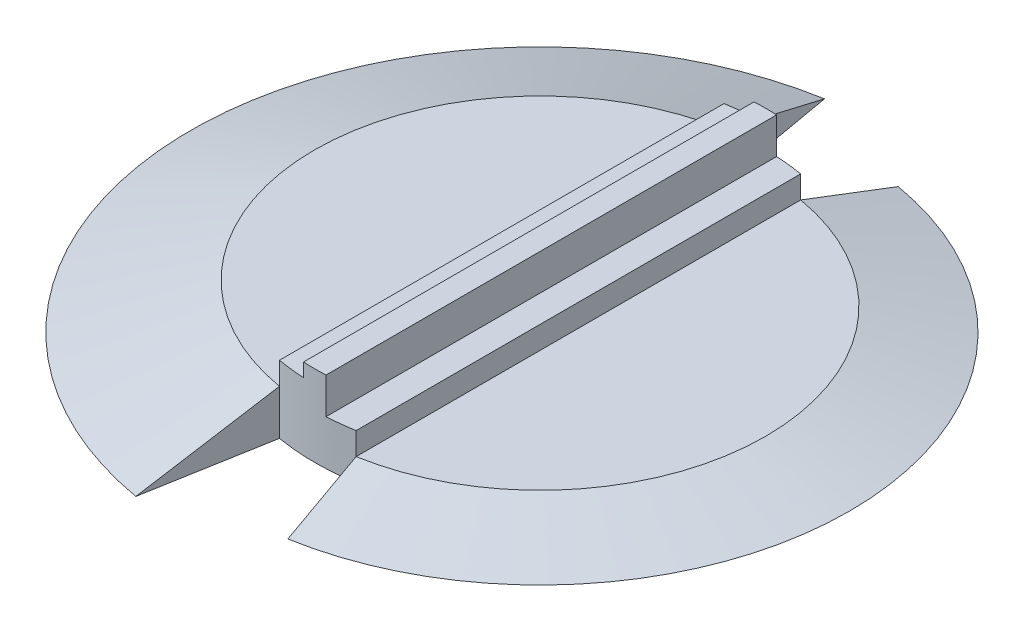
ISO-10303-21;
HEADER;
FILE_DESCRIPTION(('STEP AP214'),'2;1');
FILE_NAME('part.step','',(''),(''),'','','');
FILE_SCHEMA(('AUTOMOTIVE_DESIGN { 1 0 10303 214 1 1 1 1 }'));
ENDSEC;
DATA;
#1=APPLICATION_CONTEXT('core data for automotive mechanical design processes');
#2=APPLICATION_PROTOCOL_DEFINITION('international standard','automotive_design',2000,#1);
#3=PRODUCT_CONTEXT('',#1,'mechanical');
#4=PRODUCT('Part','Part','',(#3));
#5=PRODUCT_RELATED_PRODUCT_CATEGORY('part','',(#4));
#6=PRODUCT_DEFINITION_FORMATION('','',#4);
#7=PRODUCT_DEFINITION_CONTEXT('part definition',#1,'design');
#8=PRODUCT_DEFINITION('design','',#6,#7);
#9=PRODUCT_DEFINITION_SHAPE('','',#8);
#10=(LENGTH_UNIT() NAMED_UNIT(*) SI_UNIT(.MILLI.,.METRE.));
#11=(NAMED_UNIT(*) PLANE_ANGLE_UNIT() SI_UNIT($,.RADIAN.));
#12=(NAMED_UNIT(*) SI_UNIT($,.STERADIAN.) SOLID_ANGLE_UNIT());
#13=UNCERTAINTY_MEASURE_WITH_UNIT(LENGTH_MEASURE(1.E-05),#10,'distance_accuracy_value','');
#14=(GEOMETRIC_REPRESENTATION_CONTEXT(3) GLOBAL_UNCERTAINTY_ASSIGNED_CONTEXT((#13)) GLOBAL_UNIT_ASSIGNED_CONTEXT((#10,
#11,#12)) REPRESENTATION_CONTEXT('',''));
#15=CARTESIAN_POINT('',(0.,0.,0.));
#16=DIRECTION('',(0.,0.,1.));
#17=DIRECTION('',(1.,0.,0.));
#18=AXIS2_PLACEMENT_3D('',#15,#16,#17);
#19=CARTESIAN_POINT('',(-1000.,200.,0.));
#20=DIRECTION('',(0.,1.,0.));
#21=DIRECTION('',(0.,0.,1.));
#22=AXIS2_PLACEMENT_3D('',#19,#20,#21);
#23=PLANE('',#22);
#24=CARTESIAN_POINT('',(0.,200.,0.));
#25=DIRECTION('',(0.,1.,0.));
#26=DIRECTION('',(0.,0.,1.));
#27=AXIS2_PLACEMENT_3D('',#24,#25,#26);
#28=CIRCLE('',#27,1000.);
#29=CARTESIAN_POINT('',(-170.,200.,-985.444062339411));
#30=VERTEX_POINT('',#29);
#31=CARTESIAN_POINT('',(-170.,200.,985.44406233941));
#32=VERTEX_POINT('',#31);
#33=EDGE_CURVE('E249',#30,#32,#28,.T.);
#34=ORIENTED_EDGE('',*,*,#33,.T.);
#35=DIRECTION('',(0.,0.,1.));
#36=VECTOR('',#35,1.);
#37=CARTESIAN_POINT('',(-170.,200.,0.));
#38=LINE('',#37,#36);
#39=EDGE_CURVE('E155',#30,#32,#38,.T.);
#40=ORIENTED_EDGE('',*,*,#39,.F.);
#41=EDGE_LOOP('',(#34,#40));
#42=FACE_BOUND('',#41,.T.);
#43=ADVANCED_FACE('F37',(#42),#23,.T.);
#44=CARTESIAN_POINT('',(0.,0.,0.));
#45=DIRECTION('',(0.,-1.,0.));
#46=DIRECTION('',(0.,0.,-1.));
#47=AXIS2_PLACEMENT_3D('',#44,#45,#46);
#48=PLANE('',#47);
#49=CARTESIAN_POINT('',(0.,0.,0.));
#50=DIRECTION('',(0.,1.,0.));
#51=DIRECTION('',(0.,0.,1.));
#52=AXIS2_PLACEMENT_3D('',#49,#50,#51);
#53=CIRCLE('',#52,1000.);
#54=CARTESIAN_POINT('',(-170.,0.,985.44406233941));
#55=VERTEX_POINT('',#54);
#56=CARTESIAN_POINT('',(170.,0.,985.44406233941));
#57=VERTEX_POINT('',#56);
#58=EDGE_CURVE('E174',#55,#57,#53,.T.);
#59=ORIENTED_EDGE('',*,*,#58,.F.);
#60=DIRECTION('',(-0.173648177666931,0.,0.984807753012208));
#61=VECTOR('',#60,1.);
#62=CARTESIAN_POINT('',(-170.,0.,985.44406233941));
#63=LINE('',#62,#61);
#64=CARTESIAN_POINT('',(-265.41931167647,0.,1526.59386989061));
#65=VERTEX_POINT('',#64);
#66=EDGE_CURVE('E272',#55,#65,#63,.T.);
#67=ORIENTED_EDGE('',*,*,#66,.T.);
#68=CARTESIAN_POINT('',(0.,-2.22044604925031E-13,0.));
#69=DIRECTION('',(0.,1.,0.));
#70=DIRECTION('',(0.,0.,1.));
#71=AXIS2_PLACEMENT_3D('',#68,#69,#70);
#72=CIRCLE('',#71,1549.49548389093);
#73=CARTESIAN_POINT('',(-265.41931167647,0.,-1526.59386989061));
#74=VERTEX_POINT('',#73);
#75=EDGE_CURVE('E50',#74,#65,#72,.T.);
#76=ORIENTED_EDGE('',*,*,#75,.F.);
#77=DIRECTION('',(0.173648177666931,0.,0.984807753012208));
#78=VECTOR('',#77,1.);
#79=CARTESIAN_POINT('',(-265.41931167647,0.,-1526.59386989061));
#80=LINE('',#79,#78);
#81=CARTESIAN_POINT('',(-170.,0.,-985.44406233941));
#82=VERTEX_POINT('',#81);
#83=EDGE_CURVE('E282',#74,#82,#80,.T.);
#84=ORIENTED_EDGE('',*,*,#83,.T.);
#85=CARTESIAN_POINT('',(0.,0.,0.));
#86=DIRECTION('',(0.,1.,0.));
#87=DIRECTION('',(0.,0.,1.));
#88=AXIS2_PLACEMENT_3D('',#85,#86,#87);
#89=CIRCLE('',#88,1000.);
#90=CARTESIAN_POINT('',(170.000000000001,0.,-985.44406233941));
#91=VERTEX_POINT('',#90);
#92=EDGE_CURVE('E187',#91,#82,#89,.T.);
#93=ORIENTED_EDGE('',*,*,#92,.F.);
#94=DIRECTION('',(0.173648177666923,0.,-0.984807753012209));
#95=VECTOR('',#94,1.);
#96=CARTESIAN_POINT('',(-3.64698695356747,0.,-0.643062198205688));
#97=LINE('',#96,#95);
#98=CARTESIAN_POINT('',(234.806705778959,0.,-1352.98115461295));
#99=VERTEX_POINT('',#98);
#100=EDGE_CURVE('E301',#91,#99,#97,.T.);
#101=ORIENTED_EDGE('',*,*,#100,.T.);
#102=CARTESIAN_POINT('',(0.,0.,0.));
#103=DIRECTION('',(0.,-1.,0.));
#104=DIRECTION('',(0.,0.,-1.));
#105=AXIS2_PLACEMENT_3D('',#102,#103,#104);
#106=CIRCLE('',#105,1373.2050807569);
#107=CARTESIAN_POINT('',(234.806705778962,0.,1352.98115461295));
#108=VERTEX_POINT('',#107);
#109=EDGE_CURVE('E304',#99,#108,#106,.T.);
#110=ORIENTED_EDGE('',*,*,#109,.T.);
#111=DIRECTION('',(0.173648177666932,0.,0.984807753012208));
#112=VECTOR('',#111,1.);
#113=CARTESIAN_POINT('',(-3.64698695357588,0.,0.643062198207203));
#114=LINE('',#113,#112);
#115=EDGE_CURVE('E177',#57,#108,#114,.T.);
#116=ORIENTED_EDGE('',*,*,#115,.F.);
#117=EDGE_LOOP('',(#59,#67,#76,#84,#93,#101,#110,#116));
#118=FACE_BOUND('',#117,.T.);
#119=ADVANCED_FACE('F39',(#118),#48,.T.);
#120=CARTESIAN_POINT('',(0.,0.,0.));
#121=DIRECTION('',(0.,-1.,0.));
#122=DIRECTION('',(0.,0.,-1.));
#123=AXIS2_PLACEMENT_3D('',#120,#121,#122);
#124=CONICAL_SURFACE('',#123,1373.2050807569,1.30899693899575);
#125=CARTESIAN_POINT('',(234.806741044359,-5.44163502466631E-05,1352.98135461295));
#126=CARTESIAN_POINT('',(224.005612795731,16.6666548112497,1291.72511234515));
#127=CARTESIAN_POINT('',(213.204483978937,33.3333518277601,1230.46886685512));
#128=CARTESIAN_POINT('',(191.602225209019,66.6667214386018,1107.95636943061));
#129=CARTESIAN_POINT('',(180.801095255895,83.3333940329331,1046.70011749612));
#130=CARTESIAN_POINT('',(169.999964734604,100.000054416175,985.443862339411));
#131=B_SPLINE_CURVE_WITH_KNOTS('',3,(#125,#126,#127,#128,#129,#130),.UNSPECIFIED.,.F.,.F.,(4,2,
4),(0.,193.186275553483,386.372551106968),.UNSPECIFIED.);
#132=CARTESIAN_POINT('',(170.,99.9999999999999,985.44406233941));
#133=VERTEX_POINT('',#132);
#134=EDGE_CURVE('E181',#108,#133,#131,.T.);
#135=ORIENTED_EDGE('',*,*,#134,.F.);
#136=ORIENTED_EDGE('',*,*,#109,.F.);
#137=CARTESIAN_POINT('',(234.806741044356,-5.44163500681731E-05,-1352.98135461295));
#138=CARTESIAN_POINT('',(224.005612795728,16.6666548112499,-1291.72511234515));
#139=CARTESIAN_POINT('',(213.204483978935,33.3333518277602,-1230.46886685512));
#140=CARTESIAN_POINT('',(191.602225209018,66.6667214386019,-1107.95636943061));
#141=CARTESIAN_POINT('',(180.801095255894,83.3333940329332,-1046.70011749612));
#142=CARTESIAN_POINT('',(169.999964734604,100.000054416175,-985.44386233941));
#143=B_SPLINE_CURVE_WITH_KNOTS('',3,(#137,#138,#139,#140,#141,#142),.UNSPECIFIED.,.F.,.F.,(4,2,
4),(0.,193.186275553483,386.372551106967),.UNSPECIFIED.);
#144=CARTESIAN_POINT('',(170.000000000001,99.9999999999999,-985.44406233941));
#145=VERTEX_POINT('',#144);
#146=EDGE_CURVE('E11',#99,#145,#143,.T.);
#147=ORIENTED_EDGE('',*,*,#146,.T.);
#148=CARTESIAN_POINT('',(0.,99.9999999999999,0.));
#149=DIRECTION('',(0.,-1.,0.));
#150=DIRECTION('',(0.,0.,-1.));
#151=AXIS2_PLACEMENT_3D('',#148,#149,#150);
#152=CIRCLE('',#151,1000.);
#153=EDGE_CURVE('E308',#145,#133,#152,.T.);
#154=ORIENTED_EDGE('',*,*,#153,.T.);
#155=EDGE_LOOP('',(#135,#136,#147,#154));
#156=FACE_BOUND('',#155,.T.);
#157=ADVANCED_FACE('F189',(#156),#124,.T.);
#158=CARTESIAN_POINT('',(0.,200.,0.));
#159=DIRECTION('',(0.,-1.,0.));
#160=DIRECTION('',(0.,0.,-1.));
#161=AXIS2_PLACEMENT_3D('',#158,#159,#160);
#162=CONICAL_SURFACE('',#161,1000.,1.22173047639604);
#163=ORIENTED_EDGE('',*,*,#33,.F.);
#164=CARTESIAN_POINT('',(-169.999964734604,200.000073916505,-985.443862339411));
#165=CARTESIAN_POINT('',(-185.903198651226,166.666772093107,-1075.63558372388));
#166=CARTESIAN_POINT('',(-201.806430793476,133.333442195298,-1165.82729504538));
#167=CARTESIAN_POINT('',(-233.612891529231,66.6667262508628,-1346.21069756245));
#168=CARTESIAN_POINT('',(-249.516120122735,33.3333402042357,-1436.40238875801));
#169=CARTESIAN_POINT('',(-265.419346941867,-7.39168013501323E-05,-1526.59406989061));
#170=B_SPLINE_CURVE_WITH_KNOTS('',3,(#164,#165,#166,#167,#168,#169),.UNSPECIFIED.,.F.,.F.,(4,2,
4),(0.,292.381798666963,584.763597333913),.UNSPECIFIED.);
#171=EDGE_CURVE('E244',#30,#74,#170,.T.);
#172=ORIENTED_EDGE('',*,*,#171,.T.);
#173=ORIENTED_EDGE('',*,*,#75,.T.);
#174=CARTESIAN_POINT('',(-265.419346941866,-7.39168013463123E-05,1526.59406989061));
#175=CARTESIAN_POINT('',(-249.516120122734,33.3333402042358,1436.40238875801));
#176=CARTESIAN_POINT('',(-233.61289152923,66.6667262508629,1346.21069756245));
#177=CARTESIAN_POINT('',(-201.806430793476,133.333442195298,1165.82729504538));
#178=CARTESIAN_POINT('',(-185.903198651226,166.666772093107,1075.63558372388));
#179=CARTESIAN_POINT('',(-169.999964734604,200.000073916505,985.443862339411));
#180=B_SPLINE_CURVE_WITH_KNOTS('',3,(#174,#175,#176,#177,#178,#179),.UNSPECIFIED.,.F.,.F.,(4,2,
4),(0.,292.381798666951,584.763597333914),.UNSPECIFIED.);
#181=EDGE_CURVE('E237',#65,#32,#180,.T.);
#182=ORIENTED_EDGE('',*,*,#181,.T.);
#183=EDGE_LOOP('',(#163,#172,#173,#182));
#184=FACE_BOUND('',#183,.T.);
#185=ADVANCED_FACE('F222',(#184),#162,.T.);
#186=DIRECTION('',(0.,0.,1.));
#187=VECTOR('',#186,1.);
#188=CARTESIAN_POINT('',(50.0000000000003,200.,0.));
#189=LINE('',#188,#187);
#190=CARTESIAN_POINT('',(50.0000000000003,200.,-998.749217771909));
#191=VERTEX_POINT('',#190);
#192=CARTESIAN_POINT('',(50.0000000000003,200.,998.749217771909));
#193=VERTEX_POINT('',#192);
#194=EDGE_CURVE('E62',#191,#193,#189,.T.);
#195=ORIENTED_EDGE('',*,*,#194,.T.);
#196=CARTESIAN_POINT('',(0.,200.,0.));
#197=DIRECTION('',(0.,-1.,0.));
#198=DIRECTION('',(0.,0.,1.));
#199=AXIS2_PLACEMENT_3D('',#196,#197,#198);
#200=CIRCLE('',#199,1000.);
#201=CARTESIAN_POINT('',(170.,200.,985.44406233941));
#202=VERTEX_POINT('',#201);
#203=EDGE_CURVE('E275',#202,#193,#200,.T.);
#204=ORIENTED_EDGE('',*,*,#203,.F.);
#205=DIRECTION('',(0.,0.,1.));
#206=VECTOR('',#205,1.);
#207=CARTESIAN_POINT('',(170.,200.,-985.44406233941));
#208=LINE('',#207,#206);
#209=CARTESIAN_POINT('',(170.000000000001,200.,-985.44406233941));
#210=VERTEX_POINT('',#209);
#211=EDGE_CURVE('E286',#210,#202,#208,.T.);
#212=ORIENTED_EDGE('',*,*,#211,.F.);
#213=CARTESIAN_POINT('',(0.,200.,0.));
#214=DIRECTION('',(0.,-1.,0.));
#215=DIRECTION('',(0.,0.,1.));
#216=AXIS2_PLACEMENT_3D('',#213,#214,#215);
#217=CIRCLE('',#216,1000.);
#218=EDGE_CURVE('E57',#191,#210,#217,.T.);
#219=ORIENTED_EDGE('',*,*,#218,.F.);
#220=EDGE_LOOP('',(#195,#204,#212,#219));
#221=FACE_BOUND('',#220,.T.);
#222=ADVANCED_FACE('F213',(#221),#23,.T.);
#223=CARTESIAN_POINT('',(-265.41931167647,200.,-1526.59386989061));
#224=DIRECTION('',(0.984807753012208,0.,-0.173648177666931));
#225=DIRECTION('',(-0.173648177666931,0.,-0.984807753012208));
#226=AXIS2_PLACEMENT_3D('',#223,#224,#225);
#227=PLANE('',#226);
#228=DIRECTION('',(0.,-1.,0.));
#229=VECTOR('',#228,1.);
#230=CARTESIAN_POINT('',(-170.,200.,-985.44406233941));
#231=LINE('',#230,#229);
#232=EDGE_CURVE('E296',#30,#82,#231,.T.);
#233=ORIENTED_EDGE('',*,*,#232,.T.);
#234=ORIENTED_EDGE('',*,*,#83,.F.);
#235=ORIENTED_EDGE('',*,*,#171,.F.);
#236=EDGE_LOOP('',(#233,#234,#235));
#237=FACE_BOUND('',#236,.T.);
#238=ADVANCED_FACE('F221',(#237),#227,.T.);
#239=CARTESIAN_POINT('',(0.,200.,0.));
#240=DIRECTION('',(0.,-1.,0.));
#241=DIRECTION('',(0.,0.,-1.));
#242=AXIS2_PLACEMENT_3D('',#239,#240,#241);
#243=CYLINDRICAL_SURFACE('',#242,1000.);
#244=DIRECTION('',(0.,-1.,0.));
#245=VECTOR('',#244,1.);
#246=CARTESIAN_POINT('',(50.0000000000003,360.,-998.749217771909));
#247=LINE('',#246,#245);
#248=CARTESIAN_POINT('',(50.0000000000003,360.,-998.749217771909));
#249=VERTEX_POINT('',#248);
#250=EDGE_CURVE('E319',#249,#191,#247,.T.);
#251=ORIENTED_EDGE('',*,*,#250,.T.);
#252=ORIENTED_EDGE('',*,*,#218,.T.);
#253=DIRECTION('',(0.,-1.,0.));
#254=VECTOR('',#253,1.);
#255=CARTESIAN_POINT('',(170.000000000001,200.,-985.44406233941));
#256=LINE('',#255,#254);
#257=EDGE_CURVE('E294',#210,#145,#256,.T.);
#258=ORIENTED_EDGE('',*,*,#257,.T.);
#259=DIRECTION('',(0.,-1.,0.));
#260=VECTOR('',#259,1.);
#261=CARTESIAN_POINT('',(170.000000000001,200.,-985.44406233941));
#262=LINE('',#261,#260);
#263=EDGE_CURVE('E299',#145,#91,#262,.T.);
#264=ORIENTED_EDGE('',*,*,#263,.T.);
#265=ORIENTED_EDGE('',*,*,#92,.T.);
#266=ORIENTED_EDGE('',*,*,#232,.F.);
#267=DIRECTION('',(0.,-1.,0.));
#268=VECTOR('',#267,1.);
#269=CARTESIAN_POINT('',(-170.,300.,-985.444062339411));
#270=LINE('',#269,#268);
#271=CARTESIAN_POINT('',(-170.,300.,-985.444062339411));
#272=VERTEX_POINT('',#271);
#273=EDGE_CURVE('E172',#272,#30,#270,.T.);
#274=ORIENTED_EDGE('',*,*,#273,.F.);
#275=CARTESIAN_POINT('',(0.,300.,0.));
#276=DIRECTION('',(0.,1.,0.));
#277=DIRECTION('',(0.,0.,1.));
#278=AXIS2_PLACEMENT_3D('',#275,#276,#277);
#279=CIRCLE('',#278,1000.);
#280=CARTESIAN_POINT('',(-49.9999999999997,300.,-998.749217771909));
#281=VERTEX_POINT('',#280);
#282=EDGE_CURVE('E153',#281,#272,#279,.T.);
#283=ORIENTED_EDGE('',*,*,#282,.F.);
#284=DIRECTION('',(0.,-1.,0.));
#285=VECTOR('',#284,1.);
#286=CARTESIAN_POINT('',(-49.9999999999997,360.,-998.749217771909));
#287=LINE('',#286,#285);
#288=CARTESIAN_POINT('',(-49.9999999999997,360.,-998.749217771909));
#289=VERTEX_POINT('',#288);
#290=EDGE_CURVE('E136',#289,#281,#287,.T.);
#291=ORIENTED_EDGE('',*,*,#290,.F.);
#292=CARTESIAN_POINT('',(0.,360.,0.));
#293=DIRECTION('',(0.,1.,0.));
#294=DIRECTION('',(0.,0.,1.));
#295=AXIS2_PLACEMENT_3D('',#292,#293,#294);
#296=CIRCLE('',#295,1000.);
#297=EDGE_CURVE('E142',#249,#289,#296,.T.);
#298=ORIENTED_EDGE('',*,*,#297,.F.);
#299=EDGE_LOOP('',(#251,#252,#258,#264,#265,#266,#274,#283,#291,#298));
#300=FACE_BOUND('',#299,.T.);
#301=ADVANCED_FACE('F151',(#300),#243,.T.);
#302=CARTESIAN_POINT('',(170.,200.,-985.44406233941));
#303=DIRECTION('',(1.,0.,0.));
#304=DIRECTION('',(0.,0.,-1.));
#305=AXIS2_PLACEMENT_3D('',#302,#303,#304);
#306=PLANE('',#305);
#307=DIRECTION('',(0.,0.,1.));
#308=VECTOR('',#307,1.);
#309=CARTESIAN_POINT('',(170.,99.9999999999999,-985.44406233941));
#310=LINE('',#309,#308);
#311=EDGE_CURVE('E288',#145,#133,#310,.T.);
#312=ORIENTED_EDGE('',*,*,#311,.F.);
#313=ORIENTED_EDGE('',*,*,#257,.F.);
#314=ORIENTED_EDGE('',*,*,#211,.T.);
#315=DIRECTION('',(0.,-1.,0.));
#316=VECTOR('',#315,1.);
#317=CARTESIAN_POINT('',(170.,200.,985.44406233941));
#318=LINE('',#317,#316);
#319=EDGE_CURVE('E274',#202,#133,#318,.T.);
#320=ORIENTED_EDGE('',*,*,#319,.T.);
#321=EDGE_LOOP('',(#312,#313,#314,#320));
#322=FACE_BOUND('',#321,.T.);
#323=ADVANCED_FACE('F254',(#322),#306,.T.);
#324=CARTESIAN_POINT('',(0.,200.,0.));
#325=DIRECTION('',(0.,-1.,0.));
#326=DIRECTION('',(0.,0.,-1.));
#327=AXIS2_PLACEMENT_3D('',#324,#325,#326);
#328=CYLINDRICAL_SURFACE('',#327,1000.);
#329=ORIENTED_EDGE('',*,*,#203,.T.);
#330=DIRECTION('',(0.,-1.,0.));
#331=VECTOR('',#330,1.);
#332=CARTESIAN_POINT('',(50.0000000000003,360.,998.749217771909));
#333=LINE('',#332,#331);
#334=CARTESIAN_POINT('',(50.0000000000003,360.,998.749217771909));
#335=VERTEX_POINT('',#334);
#336=EDGE_CURVE('E160',#335,#193,#333,.T.);
#337=ORIENTED_EDGE('',*,*,#336,.F.);
#338=CARTESIAN_POINT('',(0.,360.,0.));
#339=DIRECTION('',(0.,1.,0.));
#340=DIRECTION('',(0.,0.,1.));
#341=AXIS2_PLACEMENT_3D('',#338,#339,#340);
#342=CIRCLE('',#341,1000.);
#343=CARTESIAN_POINT('',(-49.9999999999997,360.,998.749217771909));
#344=VERTEX_POINT('',#343);
#345=EDGE_CURVE('E141',#344,#335,#342,.T.);
#346=ORIENTED_EDGE('',*,*,#345,.F.);
#347=DIRECTION('',(0.,-1.,0.));
#348=VECTOR('',#347,1.);
#349=CARTESIAN_POINT('',(-49.9999999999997,360.,998.749217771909));
#350=LINE('',#349,#348);
#351=CARTESIAN_POINT('',(-49.9999999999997,300.,998.749217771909));
#352=VERTEX_POINT('',#351);
#353=EDGE_CURVE('E138',#344,#352,#350,.T.);
#354=ORIENTED_EDGE('',*,*,#353,.T.);
#355=CARTESIAN_POINT('',(0.,300.,0.));
#356=DIRECTION('',(0.,1.,0.));
#357=DIRECTION('',(0.,0.,1.));
#358=AXIS2_PLACEMENT_3D('',#355,#356,#357);
#359=CIRCLE('',#358,1000.);
#360=CARTESIAN_POINT('',(-170.,300.,985.44406233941));
#361=VERTEX_POINT('',#360);
#362=EDGE_CURVE('E168',#361,#352,#359,.T.);
#363=ORIENTED_EDGE('',*,*,#362,.F.);
#364=DIRECTION('',(0.,-1.,0.));
#365=VECTOR('',#364,1.);
#366=CARTESIAN_POINT('',(-170.,300.,985.44406233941));
#367=LINE('',#366,#365);
#368=EDGE_CURVE('E169',#361,#32,#367,.T.);
#369=ORIENTED_EDGE('',*,*,#368,.T.);
#370=DIRECTION('',(0.,-1.,0.));
#371=VECTOR('',#370,1.);
#372=CARTESIAN_POINT('',(-170.,200.,985.44406233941));
#373=LINE('',#372,#371);
#374=EDGE_CURVE('E269',#32,#55,#373,.T.);
#375=ORIENTED_EDGE('',*,*,#374,.T.);
#376=ORIENTED_EDGE('',*,*,#58,.T.);
#377=DIRECTION('',(0.,-1.,0.));
#378=VECTOR('',#377,1.);
#379=CARTESIAN_POINT('',(170.,200.,985.44406233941));
#380=LINE('',#379,#378);
#381=EDGE_CURVE('E179',#133,#57,#380,.T.);
#382=ORIENTED_EDGE('',*,*,#381,.F.);
#383=ORIENTED_EDGE('',*,*,#319,.F.);
#384=EDGE_LOOP('',(#329,#337,#346,#354,#363,#369,#375,#376,#382,#383));
#385=FACE_BOUND('',#384,.T.);
#386=ADVANCED_FACE('F257',(#385),#328,.T.);
#387=CARTESIAN_POINT('',(-170.,200.,985.44406233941));
#388=DIRECTION('',(0.984807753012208,0.,0.173648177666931));
#389=DIRECTION('',(0.173648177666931,0.,-0.984807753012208));
#390=AXIS2_PLACEMENT_3D('',#387,#388,#389);
#391=PLANE('',#390);
#392=ORIENTED_EDGE('',*,*,#374,.F.);
#393=ORIENTED_EDGE('',*,*,#181,.F.);
#394=ORIENTED_EDGE('',*,*,#66,.F.);
#395=EDGE_LOOP('',(#392,#393,#394));
#396=FACE_BOUND('',#395,.T.);
#397=ADVANCED_FACE('F207',(#396),#391,.T.);
#398=CARTESIAN_POINT('',(0.,99.9999999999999,0.));
#399=DIRECTION('',(0.,1.,0.));
#400=DIRECTION('',(0.,0.,1.));
#401=AXIS2_PLACEMENT_3D('',#398,#399,#400);
#402=PLANE('',#401);
#403=ORIENTED_EDGE('',*,*,#153,.F.);
#404=ORIENTED_EDGE('',*,*,#311,.T.);
#405=EDGE_LOOP('',(#403,#404));
#406=FACE_BOUND('',#405,.T.);
#407=ADVANCED_FACE('F202',(#406),#402,.T.);
#408=CARTESIAN_POINT('',(-3.64698695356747,200.,-0.643062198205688));
#409=DIRECTION('',(-0.984807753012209,0.,-0.173648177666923));
#410=DIRECTION('',(-0.173648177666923,0.,0.984807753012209));
#411=AXIS2_PLACEMENT_3D('',#408,#409,#410);
#412=PLANE('',#411);
#413=ORIENTED_EDGE('',*,*,#100,.F.);
#414=ORIENTED_EDGE('',*,*,#263,.F.);
#415=ORIENTED_EDGE('',*,*,#146,.F.);
#416=EDGE_LOOP('',(#413,#414,#415));
#417=FACE_BOUND('',#416,.T.);
#418=ADVANCED_FACE('F197',(#417),#412,.T.);
#419=CARTESIAN_POINT('',(-3.64698695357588,200.,0.643062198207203));
#420=DIRECTION('',(0.984807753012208,0.,-0.173648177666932));
#421=DIRECTION('',(-0.173648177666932,0.,-0.984807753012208));
#422=AXIS2_PLACEMENT_3D('',#419,#420,#421);
#423=PLANE('',#422);
#424=ORIENTED_EDGE('',*,*,#134,.T.);
#425=ORIENTED_EDGE('',*,*,#381,.T.);
#426=ORIENTED_EDGE('',*,*,#115,.T.);
#427=EDGE_LOOP('',(#424,#425,#426));
#428=FACE_BOUND('',#427,.T.);
#429=ADVANCED_FACE('F192',(#428),#423,.F.);
#430=CARTESIAN_POINT('',(-170.,300.,0.));
#431=DIRECTION('',(1.,0.,0.));
#432=DIRECTION('',(0.,0.,-1.));
#433=AXIS2_PLACEMENT_3D('',#430,#431,#432);
#434=PLANE('',#433);
#435=ORIENTED_EDGE('',*,*,#39,.T.);
#436=ORIENTED_EDGE('',*,*,#368,.F.);
#437=DIRECTION('',(0.,0.,1.));
#438=VECTOR('',#437,1.);
#439=CARTESIAN_POINT('',(-170.,300.,0.));
#440=LINE('',#439,#438);
#441=EDGE_CURVE('E166',#272,#361,#440,.T.);
#442=ORIENTED_EDGE('',*,*,#441,.F.);
#443=ORIENTED_EDGE('',*,*,#273,.T.);
#444=EDGE_LOOP('',(#435,#436,#442,#443));
#445=FACE_BOUND('',#444,.T.);
#446=ADVANCED_FACE('F196',(#445),#434,.F.);
#447=CARTESIAN_POINT('',(0.,300.,0.));
#448=DIRECTION('',(0.,1.,0.));
#449=DIRECTION('',(0.,0.,1.));
#450=AXIS2_PLACEMENT_3D('',#447,#448,#449);
#451=PLANE('',#450);
#452=DIRECTION('',(0.,0.,1.));
#453=VECTOR('',#452,1.);
#454=CARTESIAN_POINT('',(-49.9999999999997,300.,0.));
#455=LINE('',#454,#453);
#456=EDGE_CURVE('E158',#281,#352,#455,.T.);
#457=ORIENTED_EDGE('',*,*,#456,.F.);
#458=ORIENTED_EDGE('',*,*,#282,.T.);
#459=ORIENTED_EDGE('',*,*,#441,.T.);
#460=ORIENTED_EDGE('',*,*,#362,.T.);
#461=EDGE_LOOP('',(#457,#458,#459,#460));
#462=FACE_BOUND('',#461,.T.);
#463=ADVANCED_FACE('F327',(#462),#451,.T.);
#464=CARTESIAN_POINT('',(-49.9999999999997,360.,0.));
#465=DIRECTION('',(1.,0.,0.));
#466=DIRECTION('',(0.,0.,-1.));
#467=AXIS2_PLACEMENT_3D('',#464,#465,#466);
#468=PLANE('',#467);
#469=ORIENTED_EDGE('',*,*,#456,.T.);
#470=ORIENTED_EDGE('',*,*,#353,.F.);
#471=DIRECTION('',(0.,0.,1.));
#472=VECTOR('',#471,1.);
#473=CARTESIAN_POINT('',(-49.9999999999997,360.,0.));
#474=LINE('',#473,#472);
#475=EDGE_CURVE('E131',#289,#344,#474,.T.);
#476=ORIENTED_EDGE('',*,*,#475,.F.);
#477=ORIENTED_EDGE('',*,*,#290,.T.);
#478=EDGE_LOOP('',(#469,#470,#476,#477));
#479=FACE_BOUND('',#478,.T.);
#480=ADVANCED_FACE('F134',(#479),#468,.F.);
#481=CARTESIAN_POINT('',(50.0000000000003,360.,0.));
#482=DIRECTION('',(1.,0.,0.));
#483=DIRECTION('',(0.,0.,-1.));
#484=AXIS2_PLACEMENT_3D('',#481,#482,#483);
#485=PLANE('',#484);
#486=ORIENTED_EDGE('',*,*,#194,.F.);
#487=ORIENTED_EDGE('',*,*,#250,.F.);
#488=DIRECTION('',(0.,0.,1.));
#489=VECTOR('',#488,1.);
#490=CARTESIAN_POINT('',(50.0000000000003,360.,0.));
#491=LINE('',#490,#489);
#492=EDGE_CURVE('E148',#249,#335,#491,.T.);
#493=ORIENTED_EDGE('',*,*,#492,.T.);
#494=ORIENTED_EDGE('',*,*,#336,.T.);
#495=EDGE_LOOP('',(#486,#487,#493,#494));
#496=FACE_BOUND('',#495,.T.);
#497=ADVANCED_FACE('F318',(#496),#485,.T.);
#498=CARTESIAN_POINT('',(0.,360.,0.));
#499=DIRECTION('',(0.,1.,0.));
#500=DIRECTION('',(0.,0.,1.));
#501=AXIS2_PLACEMENT_3D('',#498,#499,#500);
#502=PLANE('',#501);
#503=ORIENTED_EDGE('',*,*,#297,.T.);
#504=ORIENTED_EDGE('',*,*,#475,.T.);
#505=ORIENTED_EDGE('',*,*,#345,.T.);
#506=ORIENTED_EDGE('',*,*,#492,.F.);
#507=EDGE_LOOP('',(#503,#504,#505,#506));
#508=FACE_BOUND('',#507,.T.);
#509=ADVANCED_FACE('F146',(#508),#502,.T.);
#510=CLOSED_SHELL('',(#43,#119,#157,#185,#222,#238,#301,#323,#386,#397,#407,#418,#429,#446,#463,
#480,#497,#509));
#511=MANIFOLD_SOLID_BREP('B2',#510);
#512=ADVANCED_BREP_SHAPE_REPRESENTATION('',(#18,#511),#14);
#513=SHAPE_DEFINITION_REPRESENTATION(#9,#512);
ENDSEC;
END-ISO-10303-21;
